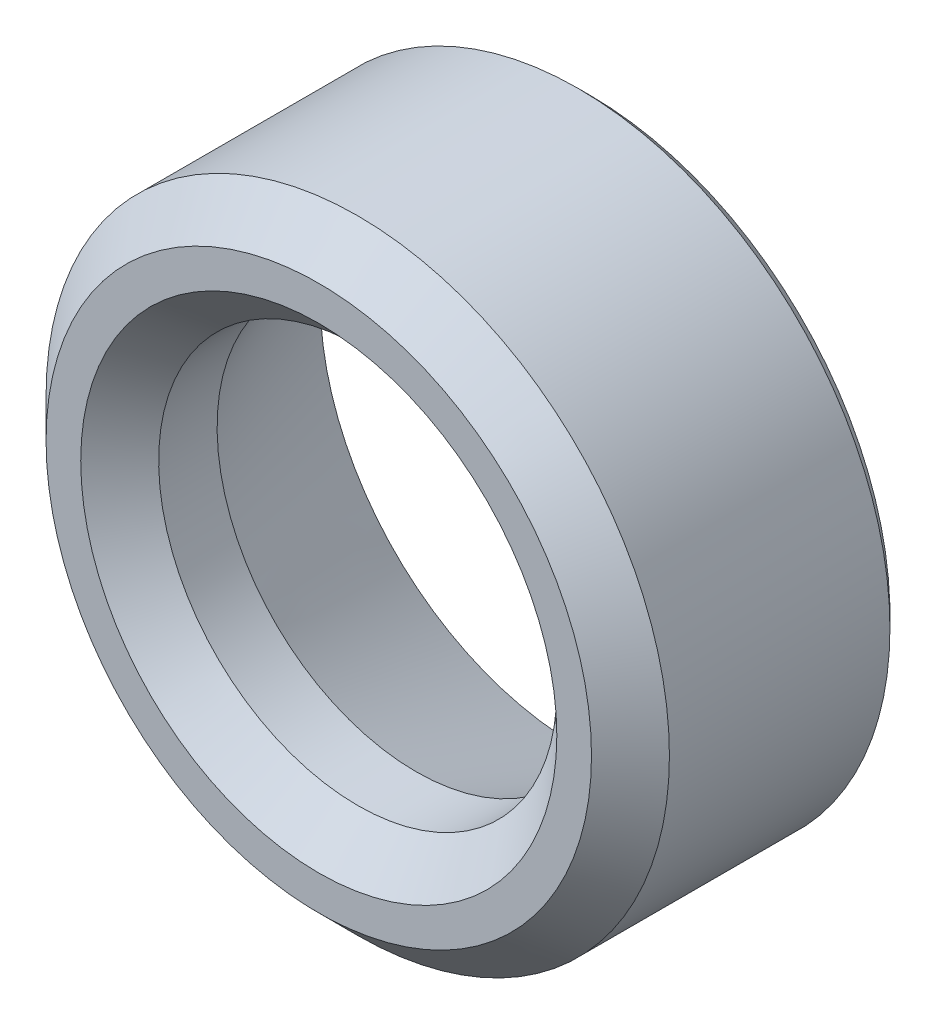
ISO-10303-21;
HEADER;
FILE_DESCRIPTION(('STEP AP214'),'2;1');
FILE_NAME('part.step','',(''),(''),'','','');
FILE_SCHEMA(('AUTOMOTIVE_DESIGN { 1 0 10303 214 1 1 1 1 }'));
ENDSEC;
DATA;
#1=APPLICATION_CONTEXT('core data for automotive mechanical design processes');
#2=APPLICATION_PROTOCOL_DEFINITION('international standard','automotive_design',2000,#1);
#3=PRODUCT_CONTEXT('',#1,'mechanical');
#4=PRODUCT('Part','Part','',(#3));
#5=PRODUCT_RELATED_PRODUCT_CATEGORY('part','',(#4));
#6=PRODUCT_DEFINITION_FORMATION('','',#4);
#7=PRODUCT_DEFINITION_CONTEXT('part definition',#1,'design');
#8=PRODUCT_DEFINITION('design','',#6,#7);
#9=PRODUCT_DEFINITION_SHAPE('','',#8);
#10=(LENGTH_UNIT() NAMED_UNIT(*) SI_UNIT(.MILLI.,.METRE.));
#11=(NAMED_UNIT(*) PLANE_ANGLE_UNIT() SI_UNIT($,.RADIAN.));
#12=(NAMED_UNIT(*) SI_UNIT($,.STERADIAN.) SOLID_ANGLE_UNIT());
#13=UNCERTAINTY_MEASURE_WITH_UNIT(LENGTH_MEASURE(1.E-05),#10,'distance_accuracy_value','');
#14=(GEOMETRIC_REPRESENTATION_CONTEXT(3) GLOBAL_UNCERTAINTY_ASSIGNED_CONTEXT((#13)) GLOBAL_UNIT_ASSIGNED_CONTEXT((#10,
#11,#12)) REPRESENTATION_CONTEXT('',''));
#15=CARTESIAN_POINT('',(0.,0.,0.));
#16=DIRECTION('',(0.,0.,1.));
#17=DIRECTION('',(1.,0.,0.));
#18=AXIS2_PLACEMENT_3D('',#15,#16,#17);
#19=CARTESIAN_POINT('',(0.,0.,0.));
#20=DIRECTION('',(0.,0.,-1.));
#21=DIRECTION('',(-1.,0.,0.));
#22=AXIS2_PLACEMENT_3D('',#19,#20,#21);
#23=CYLINDRICAL_SURFACE('',#22,2.555);
#24=CARTESIAN_POINT('',(0.,0.,-0.50000000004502));
#25=DIRECTION('',(0.,0.,1.));
#26=DIRECTION('',(1.,0.,0.));
#27=AXIS2_PLACEMENT_3D('',#24,#25,#26);
#28=CIRCLE('',#27,2.55499999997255);
#29=CARTESIAN_POINT('',(2.55499999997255,0.,-0.50000000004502));
#30=VERTEX_POINT('',#29);
#31=EDGE_CURVE('E38',#30,#30,#28,.T.);
#32=ORIENTED_EDGE('',*,*,#31,.T.);
#33=EDGE_LOOP('',(#32));
#34=FACE_BOUND('',#33,.T.);
#35=CARTESIAN_POINT('',(0.,0.,-1.24999999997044));
#36=DIRECTION('',(0.,0.,-1.));
#37=DIRECTION('',(0.,-1.,0.));
#38=AXIS2_PLACEMENT_3D('',#35,#36,#37);
#39=CIRCLE('',#38,2.55500000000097);
#40=CARTESIAN_POINT('',(0.,-2.55500000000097,-1.24999999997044));
#41=VERTEX_POINT('',#40);
#42=EDGE_CURVE('E41',#41,#41,#39,.T.);
#43=ORIENTED_EDGE('',*,*,#42,.T.);
#44=EDGE_LOOP('',(#43));
#45=FACE_BOUND('',#44,.T.);
#46=ADVANCED_FACE('F15',(#34,#45),#23,.F.);
#47=CARTESIAN_POINT('',(0.,0.,-3.32999999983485));
#48=DIRECTION('',(0.,0.,-1.));
#49=DIRECTION('',(0.,1.,0.));
#50=AXIS2_PLACEMENT_3D('',#47,#48,#49);
#51=CONICAL_SURFACE('',#50,3.31205808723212,0.34906585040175);
#52=CARTESIAN_POINT('',(0.,0.,-3.32999999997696));
#53=DIRECTION('',(0.,0.,-1.));
#54=DIRECTION('',(0.,-1.,0.));
#55=AXIS2_PLACEMENT_3D('',#52,#53,#54);
#56=CIRCLE('',#55,3.31205808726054);
#57=CARTESIAN_POINT('',(0.,-3.31205808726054,-3.32999999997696));
#58=VERTEX_POINT('',#57);
#59=EDGE_CURVE('E35',#58,#58,#56,.T.);
#60=ORIENTED_EDGE('',*,*,#59,.T.);
#61=EDGE_LOOP('',(#60));
#62=FACE_BOUND('',#61,.T.);
#63=ORIENTED_EDGE('',*,*,#42,.F.);
#64=EDGE_LOOP('',(#63));
#65=FACE_BOUND('',#64,.T.);
#66=ADVANCED_FACE('F106',(#62,#65),#51,.F.);
#67=CARTESIAN_POINT('',(0.,0.,-5.6843418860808E-11));
#68=DIRECTION('',(0.,0.,1.));
#69=DIRECTION('',(1.,0.,0.));
#70=AXIS2_PLACEMENT_3D('',#67,#68,#69);
#71=CONICAL_SURFACE('',#70,3.05499999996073,0.785398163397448);
#72=ORIENTED_EDGE('',*,*,#31,.F.);
#73=EDGE_LOOP('',(#72));
#74=FACE_BOUND('',#73,.T.);
#75=CARTESIAN_POINT('',(0.,0.,5.6843418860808E-11));
#76=DIRECTION('',(0.,0.,1.));
#77=DIRECTION('',(1.,0.,0.));
#78=AXIS2_PLACEMENT_3D('',#75,#76,#77);
#79=CIRCLE('',#78,3.05500000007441);
#80=CARTESIAN_POINT('',(3.05500000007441,0.,5.6843418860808E-11));
#81=VERTEX_POINT('',#80);
#82=EDGE_CURVE('E18',#81,#81,#79,.F.);
#83=ORIENTED_EDGE('',*,*,#82,.F.);
#84=EDGE_LOOP('',(#83));
#85=FACE_BOUND('',#84,.T.);
#86=ADVANCED_FACE('F61',(#74,#85),#71,.F.);
#87=CARTESIAN_POINT('',(0.,0.,-3.47999999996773));
#88=DIRECTION('',(0.,0.,-1.));
#89=DIRECTION('',(0.,1.,0.));
#90=AXIS2_PLACEMENT_3D('',#87,#88,#89);
#91=CONICAL_SURFACE('',#90,3.84999999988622,1.29886313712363);
#92=CARTESIAN_POINT('',(0.,0.,-3.47999999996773));
#93=DIRECTION('',(0.,0.,1.));
#94=DIRECTION('',(0.,-1.,0.));
#95=AXIS2_PLACEMENT_3D('',#92,#93,#94);
#96=CIRCLE('',#95,3.84999999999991);
#97=CARTESIAN_POINT('',(0.,-3.84999999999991,-3.47999999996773));
#98=VERTEX_POINT('',#97);
#99=EDGE_CURVE('E32',#98,#98,#96,.T.);
#100=ORIENTED_EDGE('',*,*,#99,.F.);
#101=EDGE_LOOP('',(#100));
#102=FACE_BOUND('',#101,.T.);
#103=ORIENTED_EDGE('',*,*,#59,.F.);
#104=EDGE_LOOP('',(#103));
#105=FACE_BOUND('',#104,.T.);
#106=ADVANCED_FACE('F51',(#102,#105),#91,.F.);
#107=CARTESIAN_POINT('',(0.,0.,0.));
#108=DIRECTION('',(0.,0.,1.));
#109=DIRECTION('',(1.,0.,0.));
#110=AXIS2_PLACEMENT_3D('',#107,#108,#109);
#111=PLANE('',#110);
#112=ORIENTED_EDGE('',*,*,#82,.T.);
#113=EDGE_LOOP('',(#112));
#114=FACE_BOUND('',#113,.T.);
#115=CARTESIAN_POINT('',(0.,0.,0.));
#116=DIRECTION('',(0.,0.,-1.));
#117=DIRECTION('',(-1.,0.,0.));
#118=AXIS2_PLACEMENT_3D('',#115,#116,#117);
#119=CIRCLE('',#118,3.49999999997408);
#120=CARTESIAN_POINT('',(-3.49999999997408,0.,0.));
#121=VERTEX_POINT('',#120);
#122=EDGE_CURVE('E27',#121,#121,#119,.T.);
#123=ORIENTED_EDGE('',*,*,#122,.F.);
#124=EDGE_LOOP('',(#123));
#125=FACE_BOUND('',#124,.T.);
#126=ADVANCED_FACE('F48',(#114,#125),#111,.T.);
#127=CARTESIAN_POINT('',(0.,0.,-3.33000000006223));
#128=DIRECTION('',(0.,0.,1.));
#129=DIRECTION('',(1.,0.,0.));
#130=AXIS2_PLACEMENT_3D('',#127,#128,#129);
#131=CONICAL_SURFACE('',#130,3.99999999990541,0.785398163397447);
#132=ORIENTED_EDGE('',*,*,#99,.T.);
#133=EDGE_LOOP('',(#132));
#134=FACE_BOUND('',#133,.T.);
#135=CARTESIAN_POINT('',(0.,0.,-3.33));
#136=DIRECTION('',(0.,0.,-1.));
#137=DIRECTION('',(-1.,0.,0.));
#138=AXIS2_PLACEMENT_3D('',#135,#136,#137);
#139=CIRCLE('',#138,4.);
#140=CARTESIAN_POINT('',(-4.,0.,-3.33));
#141=VERTEX_POINT('',#140);
#142=EDGE_CURVE('E22',#141,#141,#139,.F.);
#143=ORIENTED_EDGE('',*,*,#142,.F.);
#144=EDGE_LOOP('',(#143));
#145=FACE_BOUND('',#144,.T.);
#146=ADVANCED_FACE('F50',(#134,#145),#131,.T.);
#147=CARTESIAN_POINT('',(0.,0.,-0.499999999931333));
#148=DIRECTION('',(0.,0.,-1.));
#149=DIRECTION('',(-1.,0.,0.));
#150=AXIS2_PLACEMENT_3D('',#147,#148,#149);
#151=CONICAL_SURFACE('',#150,3.99999999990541,0.785398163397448);
#152=CARTESIAN_POINT('',(0.,0.,-0.5));
#153=DIRECTION('',(0.,0.,-1.));
#154=DIRECTION('',(-1.,0.,0.));
#155=AXIS2_PLACEMENT_3D('',#152,#153,#154);
#156=CIRCLE('',#155,4.);
#157=CARTESIAN_POINT('',(-4.,0.,-0.5));
#158=VERTEX_POINT('',#157);
#159=EDGE_CURVE('E10',#158,#158,#156,.T.);
#160=ORIENTED_EDGE('',*,*,#159,.F.);
#161=EDGE_LOOP('',(#160));
#162=FACE_BOUND('',#161,.T.);
#163=ORIENTED_EDGE('',*,*,#122,.T.);
#164=EDGE_LOOP('',(#163));
#165=FACE_BOUND('',#164,.T.);
#166=ADVANCED_FACE('F46',(#162,#165),#151,.T.);
#167=CARTESIAN_POINT('',(0.,0.,0.));
#168=DIRECTION('',(0.,0.,-1.));
#169=DIRECTION('',(-1.,0.,0.));
#170=AXIS2_PLACEMENT_3D('',#167,#168,#169);
#171=CYLINDRICAL_SURFACE('',#170,4.);
#172=ORIENTED_EDGE('',*,*,#159,.T.);
#173=EDGE_LOOP('',(#172));
#174=FACE_BOUND('',#173,.T.);
#175=ORIENTED_EDGE('',*,*,#142,.T.);
#176=EDGE_LOOP('',(#175));
#177=FACE_BOUND('',#176,.T.);
#178=ADVANCED_FACE('F65',(#174,#177),#171,.T.);
#179=CLOSED_SHELL('',(#46,#66,#86,#106,#126,#146,#166,#178));
#180=MANIFOLD_SOLID_BREP('B1',#179);
#181=ADVANCED_BREP_SHAPE_REPRESENTATION('',(#18,#180),#14);
#182=SHAPE_DEFINITION_REPRESENTATION(#9,#181);
ENDSEC;
END-ISO-10303-21;
